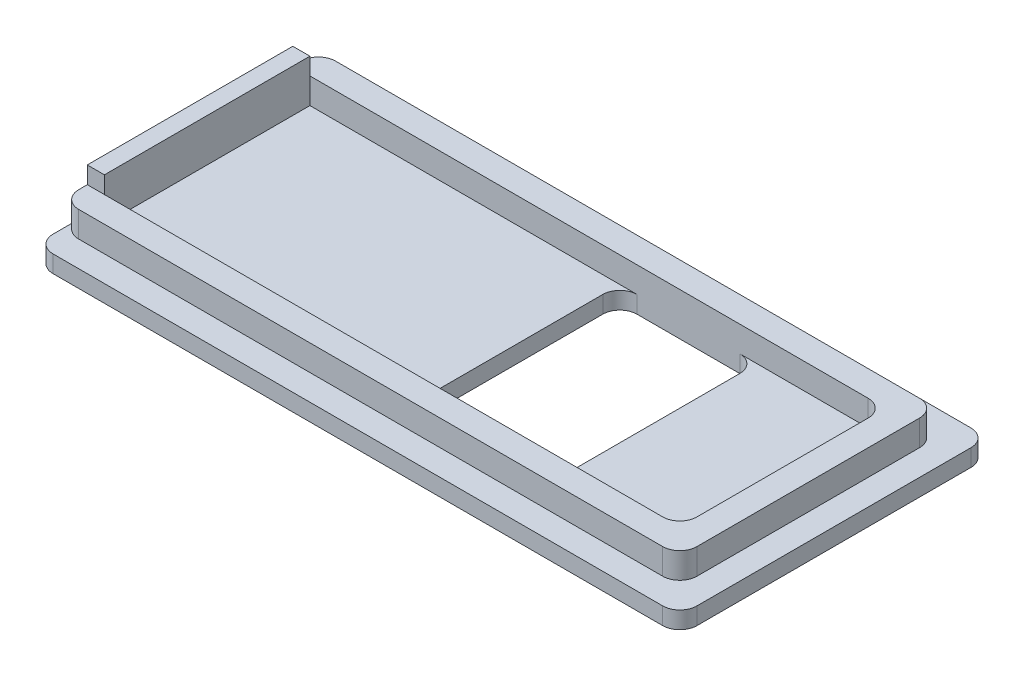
ISO-10303-21;
HEADER;
FILE_DESCRIPTION(('STEP AP214'),'2;1');
FILE_NAME('part.step','',(''),(''),'','','');
FILE_SCHEMA(('AUTOMOTIVE_DESIGN { 1 0 10303 214 1 1 1 1 }'));
ENDSEC;
DATA;
#1=APPLICATION_CONTEXT('core data for automotive mechanical design processes');
#2=APPLICATION_PROTOCOL_DEFINITION('international standard','automotive_design',2000,#1);
#3=PRODUCT_CONTEXT('',#1,'mechanical');
#4=PRODUCT('Part','Part','',(#3));
#5=PRODUCT_RELATED_PRODUCT_CATEGORY('part','',(#4));
#6=PRODUCT_DEFINITION_FORMATION('','',#4);
#7=PRODUCT_DEFINITION_CONTEXT('part definition',#1,'design');
#8=PRODUCT_DEFINITION('design','',#6,#7);
#9=PRODUCT_DEFINITION_SHAPE('','',#8);
#10=(LENGTH_UNIT() NAMED_UNIT(*) SI_UNIT(.MILLI.,.METRE.));
#11=(NAMED_UNIT(*) PLANE_ANGLE_UNIT() SI_UNIT($,.RADIAN.));
#12=(NAMED_UNIT(*) SI_UNIT($,.STERADIAN.) SOLID_ANGLE_UNIT());
#13=UNCERTAINTY_MEASURE_WITH_UNIT(LENGTH_MEASURE(1.E-05),#10,'distance_accuracy_value','');
#14=(GEOMETRIC_REPRESENTATION_CONTEXT(3) GLOBAL_UNCERTAINTY_ASSIGNED_CONTEXT((#13)) GLOBAL_UNIT_ASSIGNED_CONTEXT((#10,
#11,#12)) REPRESENTATION_CONTEXT('',''));
#15=CARTESIAN_POINT('',(0.,0.,0.));
#16=DIRECTION('',(0.,0.,1.));
#17=DIRECTION('',(1.,0.,0.));
#18=AXIS2_PLACEMENT_3D('',#15,#16,#17);
#19=CARTESIAN_POINT('',(0.,1.,0.));
#20=DIRECTION('',(0.,-1.,0.));
#21=DIRECTION('',(0.,0.,-1.));
#22=AXIS2_PLACEMENT_3D('',#19,#20,#21);
#23=PLANE('',#22);
#24=DIRECTION('',(0.,0.,1.));
#25=VECTOR('',#24,1.);
#26=CARTESIAN_POINT('',(19.1,1.,-15.));
#27=LINE('',#26,#25);
#28=CARTESIAN_POINT('',(19.1,1.,-14.));
#29=VERTEX_POINT('',#28);
#30=CARTESIAN_POINT('',(19.1,1.,-4.));
#31=VERTEX_POINT('',#30);
#32=EDGE_CURVE('E438',#29,#31,#27,.T.);
#33=ORIENTED_EDGE('',*,*,#32,.F.);
#34=CARTESIAN_POINT('',(20.1,1.,-14.));
#35=DIRECTION('',(0.,-1.,0.));
#36=DIRECTION('',(0.,0.,-1.));
#37=AXIS2_PLACEMENT_3D('',#34,#35,#36);
#38=CIRCLE('',#37,1.);
#39=CARTESIAN_POINT('',(20.1,1.,-15.));
#40=VERTEX_POINT('',#39);
#41=EDGE_CURVE('E464',#29,#40,#38,.T.);
#42=ORIENTED_EDGE('',*,*,#41,.T.);
#43=DIRECTION('',(1.,0.,0.));
#44=VECTOR('',#43,1.);
#45=CARTESIAN_POINT('',(0.,1.,-15.));
#46=LINE('',#45,#44);
#47=CARTESIAN_POINT('',(1.,1.,-15.));
#48=VERTEX_POINT('',#47);
#49=EDGE_CURVE('E51',#48,#40,#46,.T.);
#50=ORIENTED_EDGE('',*,*,#49,.F.);
#51=DIRECTION('',(0.,0.,-1.));
#52=VECTOR('',#51,1.);
#53=CARTESIAN_POINT('',(1.,1.,-15.));
#54=LINE('',#53,#52);
#55=CARTESIAN_POINT('',(1.,1.,-3.));
#56=VERTEX_POINT('',#55);
#57=EDGE_CURVE('E270',#56,#48,#54,.T.);
#58=ORIENTED_EDGE('',*,*,#57,.F.);
#59=DIRECTION('',(1.,0.,0.));
#60=VECTOR('',#59,1.);
#61=CARTESIAN_POINT('',(0.,1.,-3.));
#62=LINE('',#61,#60);
#63=CARTESIAN_POINT('',(20.1,1.,-3.));
#64=VERTEX_POINT('',#63);
#65=EDGE_CURVE('E313',#56,#64,#62,.T.);
#66=ORIENTED_EDGE('',*,*,#65,.T.);
#67=CARTESIAN_POINT('',(20.1,1.,-4.));
#68=DIRECTION('',(0.,-1.,0.));
#69=DIRECTION('',(0.,0.,-1.));
#70=AXIS2_PLACEMENT_3D('',#67,#68,#69);
#71=CIRCLE('',#70,1.);
#72=EDGE_CURVE('E490',#64,#31,#71,.T.);
#73=ORIENTED_EDGE('',*,*,#72,.T.);
#74=EDGE_LOOP('',(#33,#42,#50,#58,#66,#73));
#75=FACE_BOUND('',#74,.T.);
#76=ADVANCED_FACE('F36',(#75),#23,.F.);
#77=DIRECTION('',(0.,0.,1.));
#78=VECTOR('',#77,1.);
#79=CARTESIAN_POINT('',(34.6,1.,0.));
#80=LINE('',#79,#78);
#81=CARTESIAN_POINT('',(34.6,1.,-14.));
#82=VERTEX_POINT('',#81);
#83=CARTESIAN_POINT('',(34.6,1.,-4.));
#84=VERTEX_POINT('',#83);
#85=EDGE_CURVE('E303',#82,#84,#80,.T.);
#86=ORIENTED_EDGE('',*,*,#85,.F.);
#87=CARTESIAN_POINT('',(33.6,1.,-14.));
#88=DIRECTION('',(0.,-1.,0.));
#89=DIRECTION('',(0.,0.,-1.));
#90=AXIS2_PLACEMENT_3D('',#87,#88,#89);
#91=CIRCLE('',#90,1.);
#92=CARTESIAN_POINT('',(33.6,1.,-15.));
#93=VERTEX_POINT('',#92);
#94=EDGE_CURVE('E385',#82,#93,#91,.F.);
#95=ORIENTED_EDGE('',*,*,#94,.T.);
#96=CARTESIAN_POINT('',(26.1,1.,-15.));
#97=VERTEX_POINT('',#96);
#98=EDGE_CURVE('E59',#97,#93,#46,.T.);
#99=ORIENTED_EDGE('',*,*,#98,.F.);
#100=CARTESIAN_POINT('',(26.1,1.,-14.));
#101=DIRECTION('',(0.,-1.,0.));
#102=DIRECTION('',(0.,0.,-1.));
#103=AXIS2_PLACEMENT_3D('',#100,#101,#102);
#104=CIRCLE('',#103,1.);
#105=CARTESIAN_POINT('',(27.1,1.,-14.));
#106=VERTEX_POINT('',#105);
#107=EDGE_CURVE('E44',#97,#106,#104,.T.);
#108=ORIENTED_EDGE('',*,*,#107,.T.);
#109=DIRECTION('',(0.,0.,-1.));
#110=VECTOR('',#109,1.);
#111=CARTESIAN_POINT('',(27.1,1.,-15.));
#112=LINE('',#111,#110);
#113=CARTESIAN_POINT('',(27.1,1.,-4.));
#114=VERTEX_POINT('',#113);
#115=EDGE_CURVE('E433',#114,#106,#112,.T.);
#116=ORIENTED_EDGE('',*,*,#115,.F.);
#117=CARTESIAN_POINT('',(26.1,1.,-4.));
#118=DIRECTION('',(0.,-1.,0.));
#119=DIRECTION('',(0.,0.,-1.));
#120=AXIS2_PLACEMENT_3D('',#117,#118,#119);
#121=CIRCLE('',#120,1.);
#122=CARTESIAN_POINT('',(26.1,1.,-3.));
#123=VERTEX_POINT('',#122);
#124=EDGE_CURVE('E478',#114,#123,#121,.T.);
#125=ORIENTED_EDGE('',*,*,#124,.T.);
#126=CARTESIAN_POINT('',(33.6,1.,-3.));
#127=VERTEX_POINT('',#126);
#128=EDGE_CURVE('E306',#123,#127,#62,.T.);
#129=ORIENTED_EDGE('',*,*,#128,.T.);
#130=CARTESIAN_POINT('',(33.6,1.,-4.));
#131=DIRECTION('',(0.,-1.,0.));
#132=DIRECTION('',(0.,0.,-1.));
#133=AXIS2_PLACEMENT_3D('',#130,#131,#132);
#134=CIRCLE('',#133,1.);
#135=EDGE_CURVE('E383',#127,#84,#134,.F.);
#136=ORIENTED_EDGE('',*,*,#135,.T.);
#137=EDGE_LOOP('',(#86,#95,#99,#108,#116,#125,#129,#136));
#138=FACE_BOUND('',#137,.T.);
#139=ADVANCED_FACE('F495',(#138),#23,.F.);
#140=CARTESIAN_POINT('',(0.,2.5,-15.));
#141=DIRECTION('',(0.,0.,-1.));
#142=DIRECTION('',(-1.,0.,0.));
#143=AXIS2_PLACEMENT_3D('',#140,#141,#142);
#144=PLANE('',#143);
#145=ORIENTED_EDGE('',*,*,#49,.T.);
#146=DIRECTION('',(0.,1.,0.));
#147=VECTOR('',#146,1.);
#148=CARTESIAN_POINT('',(20.1,0.,-15.));
#149=LINE('',#148,#147);
#150=CARTESIAN_POINT('',(20.1,0.,-15.));
#151=VERTEX_POINT('',#150);
#152=EDGE_CURVE('E474',#40,#151,#149,.F.);
#153=ORIENTED_EDGE('',*,*,#152,.T.);
#154=DIRECTION('',(-1.,0.,0.));
#155=VECTOR('',#154,1.);
#156=CARTESIAN_POINT('',(19.1,0.,-15.));
#157=LINE('',#156,#155);
#158=CARTESIAN_POINT('',(26.1,0.,-15.));
#159=VERTEX_POINT('',#158);
#160=EDGE_CURVE('E449',#159,#151,#157,.T.);
#161=ORIENTED_EDGE('',*,*,#160,.F.);
#162=DIRECTION('',(0.,1.,0.));
#163=VECTOR('',#162,1.);
#164=CARTESIAN_POINT('',(26.1,1.,-15.));
#165=LINE('',#164,#163);
#166=EDGE_CURVE('E479',#159,#97,#165,.T.);
#167=ORIENTED_EDGE('',*,*,#166,.T.);
#168=ORIENTED_EDGE('',*,*,#98,.T.);
#169=DIRECTION('',(0.,-1.,0.));
#170=VECTOR('',#169,1.);
#171=CARTESIAN_POINT('',(33.6,2.5,-15.));
#172=LINE('',#171,#170);
#173=CARTESIAN_POINT('',(33.6,2.5,-15.));
#174=VERTEX_POINT('',#173);
#175=EDGE_CURVE('E387',#93,#174,#172,.F.);
#176=ORIENTED_EDGE('',*,*,#175,.T.);
#177=DIRECTION('',(1.,0.,0.));
#178=VECTOR('',#177,1.);
#179=CARTESIAN_POINT('',(0.,2.5,-15.));
#180=LINE('',#179,#178);
#181=CARTESIAN_POINT('',(1.,2.5,-15.));
#182=VERTEX_POINT('',#181);
#183=EDGE_CURVE('E287',#182,#174,#180,.T.);
#184=ORIENTED_EDGE('',*,*,#183,.F.);
#185=DIRECTION('',(0.,-1.,0.));
#186=VECTOR('',#185,1.);
#187=CARTESIAN_POINT('',(1.,3.5,-15.));
#188=LINE('',#187,#186);
#189=EDGE_CURVE('E450',#182,#48,#188,.T.);
#190=ORIENTED_EDGE('',*,*,#189,.T.);
#191=EDGE_LOOP('',(#145,#153,#161,#167,#168,#176,#184,#190));
#192=FACE_BOUND('',#191,.T.);
#193=ADVANCED_FACE('F457',(#192),#144,.F.);
#194=CARTESIAN_POINT('',(0.,2.5,-3.));
#195=DIRECTION('',(0.,0.,-1.));
#196=DIRECTION('',(-1.,0.,0.));
#197=AXIS2_PLACEMENT_3D('',#194,#195,#196);
#198=PLANE('',#197);
#199=ORIENTED_EDGE('',*,*,#128,.F.);
#200=DIRECTION('',(0.,1.,0.));
#201=VECTOR('',#200,1.);
#202=CARTESIAN_POINT('',(26.1,2.5,-3.));
#203=LINE('',#202,#201);
#204=CARTESIAN_POINT('',(26.1,0.,-3.));
#205=VERTEX_POINT('',#204);
#206=EDGE_CURVE('E509',#123,#205,#203,.F.);
#207=ORIENTED_EDGE('',*,*,#206,.T.);
#208=DIRECTION('',(1.,0.,0.));
#209=VECTOR('',#208,1.);
#210=CARTESIAN_POINT('',(19.1,0.,-3.));
#211=LINE('',#210,#209);
#212=CARTESIAN_POINT('',(20.1,0.,-3.));
#213=VERTEX_POINT('',#212);
#214=EDGE_CURVE('E528',#213,#205,#211,.T.);
#215=ORIENTED_EDGE('',*,*,#214,.F.);
#216=DIRECTION('',(0.,1.,0.));
#217=VECTOR('',#216,1.);
#218=CARTESIAN_POINT('',(20.1,2.5,-3.));
#219=LINE('',#218,#217);
#220=EDGE_CURVE('E507',#213,#64,#219,.T.);
#221=ORIENTED_EDGE('',*,*,#220,.T.);
#222=ORIENTED_EDGE('',*,*,#65,.F.);
#223=DIRECTION('',(0.,-1.,0.));
#224=VECTOR('',#223,1.);
#225=CARTESIAN_POINT('',(1.,3.5,-3.));
#226=LINE('',#225,#224);
#227=CARTESIAN_POINT('',(1.,2.5,-3.));
#228=VERTEX_POINT('',#227);
#229=EDGE_CURVE('E279',#228,#56,#226,.T.);
#230=ORIENTED_EDGE('',*,*,#229,.F.);
#231=DIRECTION('',(1.,0.,0.));
#232=VECTOR('',#231,1.);
#233=CARTESIAN_POINT('',(0.,2.5,-3.));
#234=LINE('',#233,#232);
#235=CARTESIAN_POINT('',(33.6,2.5,-3.));
#236=VERTEX_POINT('',#235);
#237=EDGE_CURVE('E290',#228,#236,#234,.T.);
#238=ORIENTED_EDGE('',*,*,#237,.T.);
#239=DIRECTION('',(0.,-1.,0.));
#240=VECTOR('',#239,1.);
#241=CARTESIAN_POINT('',(33.6,2.5,-3.));
#242=LINE('',#241,#240);
#243=EDGE_CURVE('E389',#236,#127,#242,.T.);
#244=ORIENTED_EDGE('',*,*,#243,.T.);
#245=EDGE_LOOP('',(#199,#207,#215,#221,#222,#230,#238,#244));
#246=FACE_BOUND('',#245,.T.);
#247=ADVANCED_FACE('F533',(#246),#198,.T.);
#248=CARTESIAN_POINT('',(0.,1.,0.));
#249=DIRECTION('',(1.,0.,0.));
#250=DIRECTION('',(0.,0.,-1.));
#251=AXIS2_PLACEMENT_3D('',#248,#249,#250);
#252=PLANE('',#251);
#253=DIRECTION('',(0.,0.,1.));
#254=VECTOR('',#253,1.);
#255=CARTESIAN_POINT('',(0.,2.5,0.));
#256=LINE('',#255,#254);
#257=CARTESIAN_POINT('',(0.,2.5,-15.5));
#258=VERTEX_POINT('',#257);
#259=CARTESIAN_POINT('',(0.,2.5,-15.));
#260=VERTEX_POINT('',#259);
#261=EDGE_CURVE('E295',#258,#260,#256,.T.);
#262=ORIENTED_EDGE('',*,*,#261,.F.);
#263=DIRECTION('',(0.,-1.,0.));
#264=VECTOR('',#263,1.);
#265=CARTESIAN_POINT('',(0.,1.,-15.5));
#266=LINE('',#265,#264);
#267=CARTESIAN_POINT('',(0.,1.,-15.5));
#268=VERTEX_POINT('',#267);
#269=EDGE_CURVE('E421',#258,#268,#266,.T.);
#270=ORIENTED_EDGE('',*,*,#269,.T.);
#271=DIRECTION('',(0.,0.,1.));
#272=VECTOR('',#271,1.);
#273=CARTESIAN_POINT('',(0.,1.,0.));
#274=LINE('',#273,#272);
#275=CARTESIAN_POINT('',(0.,1.,-17.));
#276=VERTEX_POINT('',#275);
#277=EDGE_CURVE('E330',#276,#268,#274,.T.);
#278=ORIENTED_EDGE('',*,*,#277,.F.);
#279=DIRECTION('',(0.,-1.,0.));
#280=VECTOR('',#279,1.);
#281=CARTESIAN_POINT('',(0.,1.,-17.));
#282=LINE('',#281,#280);
#283=CARTESIAN_POINT('',(0.,0.,-17.));
#284=VERTEX_POINT('',#283);
#285=EDGE_CURVE('E345',#276,#284,#282,.T.);
#286=ORIENTED_EDGE('',*,*,#285,.T.);
#287=DIRECTION('',(0.,0.,1.));
#288=VECTOR('',#287,1.);
#289=CARTESIAN_POINT('',(0.,0.,0.));
#290=LINE('',#289,#288);
#291=CARTESIAN_POINT('',(0.,0.,-1.));
#292=VERTEX_POINT('',#291);
#293=EDGE_CURVE('E562',#284,#292,#290,.T.);
#294=ORIENTED_EDGE('',*,*,#293,.T.);
#295=DIRECTION('',(0.,-1.,0.));
#296=VECTOR('',#295,1.);
#297=CARTESIAN_POINT('',(0.,1.,-1.));
#298=LINE('',#297,#296);
#299=CARTESIAN_POINT('',(0.,1.,-1.));
#300=VERTEX_POINT('',#299);
#301=EDGE_CURVE('E343',#292,#300,#298,.F.);
#302=ORIENTED_EDGE('',*,*,#301,.T.);
#303=CARTESIAN_POINT('',(0.,1.,-2.5));
#304=VERTEX_POINT('',#303);
#305=EDGE_CURVE('E324',#304,#300,#274,.T.);
#306=ORIENTED_EDGE('',*,*,#305,.F.);
#307=DIRECTION('',(0.,-1.,0.));
#308=VECTOR('',#307,1.);
#309=CARTESIAN_POINT('',(0.,1.,-2.5));
#310=LINE('',#309,#308);
#311=CARTESIAN_POINT('',(0.,2.5,-2.5));
#312=VERTEX_POINT('',#311);
#313=EDGE_CURVE('E348',#304,#312,#310,.F.);
#314=ORIENTED_EDGE('',*,*,#313,.T.);
#315=CARTESIAN_POINT('',(0.,2.5,-3.));
#316=VERTEX_POINT('',#315);
#317=EDGE_CURVE('E275',#316,#312,#256,.T.);
#318=ORIENTED_EDGE('',*,*,#317,.F.);
#319=DIRECTION('',(0.,-1.,0.));
#320=VECTOR('',#319,1.);
#321=CARTESIAN_POINT('',(0.,3.5,-3.));
#322=LINE('',#321,#320);
#323=CARTESIAN_POINT('',(0.,3.5,-3.));
#324=VERTEX_POINT('',#323);
#325=EDGE_CURVE('E254',#324,#316,#322,.T.);
#326=ORIENTED_EDGE('',*,*,#325,.F.);
#327=DIRECTION('',(0.,0.,1.));
#328=VECTOR('',#327,1.);
#329=CARTESIAN_POINT('',(0.,3.5,-3.));
#330=LINE('',#329,#328);
#331=CARTESIAN_POINT('',(0.,3.5,-15.));
#332=VERTEX_POINT('',#331);
#333=EDGE_CURVE('E261',#332,#324,#330,.T.);
#334=ORIENTED_EDGE('',*,*,#333,.F.);
#335=DIRECTION('',(0.,-1.,0.));
#336=VECTOR('',#335,1.);
#337=CARTESIAN_POINT('',(0.,3.5,-15.));
#338=LINE('',#337,#336);
#339=EDGE_CURVE('E447',#332,#260,#338,.T.);
#340=ORIENTED_EDGE('',*,*,#339,.T.);
#341=EDGE_LOOP('',(#262,#270,#278,#286,#294,#302,#306,#314,#318,#326,#334,#340));
#342=FACE_BOUND('',#341,.T.);
#343=ADVANCED_FACE('F273',(#342),#252,.F.);
#344=CARTESIAN_POINT('',(0.,1.,0.));
#345=DIRECTION('',(0.,0.,-1.));
#346=DIRECTION('',(-1.,0.,0.));
#347=AXIS2_PLACEMENT_3D('',#344,#345,#346);
#348=PLANE('',#347);
#349=DIRECTION('',(1.,0.,0.));
#350=VECTOR('',#349,1.);
#351=CARTESIAN_POINT('',(0.,0.,0.));
#352=LINE('',#351,#350);
#353=CARTESIAN_POINT('',(1.,0.,0.));
#354=VERTEX_POINT('',#353);
#355=CARTESIAN_POINT('',(36.6,0.,0.));
#356=VERTEX_POINT('',#355);
#357=EDGE_CURVE('E607',#354,#356,#352,.T.);
#358=ORIENTED_EDGE('',*,*,#357,.T.);
#359=DIRECTION('',(0.,-1.,0.));
#360=VECTOR('',#359,1.);
#361=CARTESIAN_POINT('',(36.6,1.,0.));
#362=LINE('',#361,#360);
#363=CARTESIAN_POINT('',(36.6,1.,0.));
#364=VERTEX_POINT('',#363);
#365=EDGE_CURVE('E408',#356,#364,#362,.F.);
#366=ORIENTED_EDGE('',*,*,#365,.T.);
#367=DIRECTION('',(1.,0.,0.));
#368=VECTOR('',#367,1.);
#369=CARTESIAN_POINT('',(0.,1.,0.));
#370=LINE('',#369,#368);
#371=CARTESIAN_POINT('',(1.,1.,0.));
#372=VERTEX_POINT('',#371);
#373=EDGE_CURVE('E336',#372,#364,#370,.T.);
#374=ORIENTED_EDGE('',*,*,#373,.F.);
#375=DIRECTION('',(0.,-1.,0.));
#376=VECTOR('',#375,1.);
#377=CARTESIAN_POINT('',(1.,1.,0.));
#378=LINE('',#377,#376);
#379=EDGE_CURVE('E405',#372,#354,#378,.T.);
#380=ORIENTED_EDGE('',*,*,#379,.T.);
#381=EDGE_LOOP('',(#358,#366,#374,#380));
#382=FACE_BOUND('',#381,.T.);
#383=ADVANCED_FACE('F632',(#382),#348,.F.);
#384=CARTESIAN_POINT('',(37.6,1.,0.));
#385=DIRECTION('',(-1.,0.,0.));
#386=DIRECTION('',(0.,0.,1.));
#387=AXIS2_PLACEMENT_3D('',#384,#385,#386);
#388=PLANE('',#387);
#389=DIRECTION('',(0.,0.,-1.));
#390=VECTOR('',#389,1.);
#391=CARTESIAN_POINT('',(37.6,0.,0.));
#392=LINE('',#391,#390);
#393=CARTESIAN_POINT('',(37.6,0.,-1.));
#394=VERTEX_POINT('',#393);
#395=CARTESIAN_POINT('',(37.6,0.,-17.));
#396=VERTEX_POINT('',#395);
#397=EDGE_CURVE('E609',#394,#396,#392,.T.);
#398=ORIENTED_EDGE('',*,*,#397,.T.);
#399=DIRECTION('',(0.,-1.,0.));
#400=VECTOR('',#399,1.);
#401=CARTESIAN_POINT('',(37.6,1.,-17.));
#402=LINE('',#401,#400);
#403=CARTESIAN_POINT('',(37.6,1.,-17.));
#404=VERTEX_POINT('',#403);
#405=EDGE_CURVE('E403',#396,#404,#402,.F.);
#406=ORIENTED_EDGE('',*,*,#405,.T.);
#407=DIRECTION('',(0.,0.,-1.));
#408=VECTOR('',#407,1.);
#409=CARTESIAN_POINT('',(37.6,1.,0.));
#410=LINE('',#409,#408);
#411=CARTESIAN_POINT('',(37.6,1.,-1.));
#412=VERTEX_POINT('',#411);
#413=EDGE_CURVE('E599',#412,#404,#410,.T.);
#414=ORIENTED_EDGE('',*,*,#413,.F.);
#415=DIRECTION('',(0.,-1.,0.));
#416=VECTOR('',#415,1.);
#417=CARTESIAN_POINT('',(37.6,1.,-1.));
#418=LINE('',#417,#416);
#419=EDGE_CURVE('E400',#412,#394,#418,.T.);
#420=ORIENTED_EDGE('',*,*,#419,.T.);
#421=EDGE_LOOP('',(#398,#406,#414,#420));
#422=FACE_BOUND('',#421,.T.);
#423=ADVANCED_FACE('F640',(#422),#388,.F.);
#424=CARTESIAN_POINT('',(0.,1.,-18.));
#425=DIRECTION('',(0.,0.,1.));
#426=DIRECTION('',(1.,0.,0.));
#427=AXIS2_PLACEMENT_3D('',#424,#425,#426);
#428=PLANE('',#427);
#429=DIRECTION('',(-1.,0.,0.));
#430=VECTOR('',#429,1.);
#431=CARTESIAN_POINT('',(0.,0.,-18.));
#432=LINE('',#431,#430);
#433=CARTESIAN_POINT('',(36.6,0.,-18.));
#434=VERTEX_POINT('',#433);
#435=CARTESIAN_POINT('',(1.,0.,-18.));
#436=VERTEX_POINT('',#435);
#437=EDGE_CURVE('E331',#434,#436,#432,.T.);
#438=ORIENTED_EDGE('',*,*,#437,.T.);
#439=DIRECTION('',(0.,-1.,0.));
#440=VECTOR('',#439,1.);
#441=CARTESIAN_POINT('',(1.,1.,-18.));
#442=LINE('',#441,#440);
#443=CARTESIAN_POINT('',(1.,1.,-18.));
#444=VERTEX_POINT('',#443);
#445=EDGE_CURVE('E368',#436,#444,#442,.F.);
#446=ORIENTED_EDGE('',*,*,#445,.T.);
#447=DIRECTION('',(-1.,0.,0.));
#448=VECTOR('',#447,1.);
#449=CARTESIAN_POINT('',(0.,1.,-18.));
#450=LINE('',#449,#448);
#451=CARTESIAN_POINT('',(36.6,1.,-18.));
#452=VERTEX_POINT('',#451);
#453=EDGE_CURVE('E598',#452,#444,#450,.T.);
#454=ORIENTED_EDGE('',*,*,#453,.F.);
#455=DIRECTION('',(0.,-1.,0.));
#456=VECTOR('',#455,1.);
#457=CARTESIAN_POINT('',(36.6,1.,-18.));
#458=LINE('',#457,#456);
#459=EDGE_CURVE('E365',#452,#434,#458,.T.);
#460=ORIENTED_EDGE('',*,*,#459,.T.);
#461=EDGE_LOOP('',(#438,#446,#454,#460));
#462=FACE_BOUND('',#461,.T.);
#463=ADVANCED_FACE('F618',(#462),#428,.F.);
#464=ORIENTED_EDGE('',*,*,#453,.T.);
#465=CARTESIAN_POINT('',(1.,1.,-17.));
#466=DIRECTION('',(0.,-1.,0.));
#467=DIRECTION('',(0.,0.,-1.));
#468=AXIS2_PLACEMENT_3D('',#465,#466,#467);
#469=CIRCLE('',#468,1.);
#470=EDGE_CURVE('E376',#444,#276,#469,.F.);
#471=ORIENTED_EDGE('',*,*,#470,.T.);
#472=ORIENTED_EDGE('',*,*,#277,.T.);
#473=CARTESIAN_POINT('',(1.,1.,-15.5));
#474=DIRECTION('',(0.,-1.,0.));
#475=DIRECTION('',(0.,0.,-1.));
#476=AXIS2_PLACEMENT_3D('',#473,#474,#475);
#477=CIRCLE('',#476,1.);
#478=CARTESIAN_POINT('',(1.,1.,-16.5));
#479=VERTEX_POINT('',#478);
#480=EDGE_CURVE('E430',#268,#479,#477,.T.);
#481=ORIENTED_EDGE('',*,*,#480,.T.);
#482=DIRECTION('',(1.,0.,0.));
#483=VECTOR('',#482,1.);
#484=CARTESIAN_POINT('',(0.,1.,-16.5));
#485=LINE('',#484,#483);
#486=CARTESIAN_POINT('',(35.1,1.,-16.5));
#487=VERTEX_POINT('',#486);
#488=EDGE_CURVE('E425',#479,#487,#485,.T.);
#489=ORIENTED_EDGE('',*,*,#488,.T.);
#490=CARTESIAN_POINT('',(35.1,1.,-15.5));
#491=DIRECTION('',(0.,-1.,0.));
#492=DIRECTION('',(0.,0.,-1.));
#493=AXIS2_PLACEMENT_3D('',#490,#491,#492);
#494=CIRCLE('',#493,1.);
#495=CARTESIAN_POINT('',(36.1,1.,-15.5));
#496=VERTEX_POINT('',#495);
#497=EDGE_CURVE('E417',#487,#496,#494,.T.);
#498=ORIENTED_EDGE('',*,*,#497,.T.);
#499=DIRECTION('',(0.,0.,1.));
#500=VECTOR('',#499,1.);
#501=CARTESIAN_POINT('',(36.1,1.,0.));
#502=LINE('',#501,#500);
#503=CARTESIAN_POINT('',(36.1,1.,-2.5));
#504=VERTEX_POINT('',#503);
#505=EDGE_CURVE('E309',#496,#504,#502,.T.);
#506=ORIENTED_EDGE('',*,*,#505,.T.);
#507=CARTESIAN_POINT('',(35.1,1.,-2.5));
#508=DIRECTION('',(0.,-1.,0.));
#509=DIRECTION('',(0.,0.,-1.));
#510=AXIS2_PLACEMENT_3D('',#507,#508,#509);
#511=CIRCLE('',#510,1.);
#512=CARTESIAN_POINT('',(35.1,1.,-1.5));
#513=VERTEX_POINT('',#512);
#514=EDGE_CURVE('E419',#504,#513,#511,.T.);
#515=ORIENTED_EDGE('',*,*,#514,.T.);
#516=DIRECTION('',(1.,0.,0.));
#517=VECTOR('',#516,1.);
#518=CARTESIAN_POINT('',(0.,1.,-1.5));
#519=LINE('',#518,#517);
#520=CARTESIAN_POINT('',(1.,1.,-1.5));
#521=VERTEX_POINT('',#520);
#522=EDGE_CURVE('E320',#521,#513,#519,.T.);
#523=ORIENTED_EDGE('',*,*,#522,.F.);
#524=CARTESIAN_POINT('',(1.,1.,-2.5));
#525=DIRECTION('',(0.,-1.,0.));
#526=DIRECTION('',(0.,0.,-1.));
#527=AXIS2_PLACEMENT_3D('',#524,#525,#526);
#528=CIRCLE('',#527,1.);
#529=EDGE_CURVE('E410',#521,#304,#528,.T.);
#530=ORIENTED_EDGE('',*,*,#529,.T.);
#531=ORIENTED_EDGE('',*,*,#305,.T.);
#532=CARTESIAN_POINT('',(1.,1.,-1.));
#533=DIRECTION('',(0.,-1.,0.));
#534=DIRECTION('',(0.,0.,-1.));
#535=AXIS2_PLACEMENT_3D('',#532,#533,#534);
#536=CIRCLE('',#535,1.);
#537=EDGE_CURVE('E370',#300,#372,#536,.F.);
#538=ORIENTED_EDGE('',*,*,#537,.T.);
#539=ORIENTED_EDGE('',*,*,#373,.T.);
#540=CARTESIAN_POINT('',(36.6,1.,-1.));
#541=DIRECTION('',(0.,-1.,0.));
#542=DIRECTION('',(0.,0.,-1.));
#543=AXIS2_PLACEMENT_3D('',#540,#541,#542);
#544=CIRCLE('',#543,1.);
#545=EDGE_CURVE('E372',#364,#412,#544,.F.);
#546=ORIENTED_EDGE('',*,*,#545,.T.);
#547=ORIENTED_EDGE('',*,*,#413,.T.);
#548=CARTESIAN_POINT('',(36.6,1.,-17.));
#549=DIRECTION('',(0.,-1.,0.));
#550=DIRECTION('',(0.,0.,-1.));
#551=AXIS2_PLACEMENT_3D('',#548,#549,#550);
#552=CIRCLE('',#551,1.);
#553=EDGE_CURVE('E374',#404,#452,#552,.F.);
#554=ORIENTED_EDGE('',*,*,#553,.T.);
#555=EDGE_LOOP('',(#464,#471,#472,#481,#489,#498,#506,#515,#523,#530,#531,#538,#539,#546,#547,#554));
#556=FACE_BOUND('',#555,.T.);
#557=ADVANCED_FACE('F571',(#556),#23,.F.);
#558=CARTESIAN_POINT('',(0.,0.,0.));
#559=DIRECTION('',(0.,-1.,0.));
#560=DIRECTION('',(0.,0.,-1.));
#561=AXIS2_PLACEMENT_3D('',#558,#559,#560);
#562=PLANE('',#561);
#563=ORIENTED_EDGE('',*,*,#160,.T.);
#564=CARTESIAN_POINT('',(20.1,0.,-14.));
#565=DIRECTION('',(0.,-1.,0.));
#566=DIRECTION('',(0.,0.,-1.));
#567=AXIS2_PLACEMENT_3D('',#564,#565,#566);
#568=CIRCLE('',#567,1.);
#569=CARTESIAN_POINT('',(19.1,0.,-14.));
#570=VERTEX_POINT('',#569);
#571=EDGE_CURVE('E470',#151,#570,#568,.F.);
#572=ORIENTED_EDGE('',*,*,#571,.T.);
#573=DIRECTION('',(0.,0.,1.));
#574=VECTOR('',#573,1.);
#575=CARTESIAN_POINT('',(19.1,0.,-15.));
#576=LINE('',#575,#574);
#577=CARTESIAN_POINT('',(19.1,0.,-4.));
#578=VERTEX_POINT('',#577);
#579=EDGE_CURVE('E437',#570,#578,#576,.T.);
#580=ORIENTED_EDGE('',*,*,#579,.T.);
#581=CARTESIAN_POINT('',(20.1,0.,-4.));
#582=DIRECTION('',(0.,-1.,0.));
#583=DIRECTION('',(0.,0.,-1.));
#584=AXIS2_PLACEMENT_3D('',#581,#582,#583);
#585=CIRCLE('',#584,1.);
#586=EDGE_CURVE('E471',#578,#213,#585,.F.);
#587=ORIENTED_EDGE('',*,*,#586,.T.);
#588=ORIENTED_EDGE('',*,*,#214,.T.);
#589=CARTESIAN_POINT('',(26.1,0.,-4.));
#590=DIRECTION('',(0.,-1.,0.));
#591=DIRECTION('',(0.,0.,-1.));
#592=AXIS2_PLACEMENT_3D('',#589,#590,#591);
#593=CIRCLE('',#592,1.);
#594=CARTESIAN_POINT('',(27.1,0.,-4.));
#595=VERTEX_POINT('',#594);
#596=EDGE_CURVE('E482',#205,#595,#593,.F.);
#597=ORIENTED_EDGE('',*,*,#596,.T.);
#598=DIRECTION('',(0.,0.,-1.));
#599=VECTOR('',#598,1.);
#600=CARTESIAN_POINT('',(27.1,0.,-15.));
#601=LINE('',#600,#599);
#602=CARTESIAN_POINT('',(27.1,0.,-14.));
#603=VERTEX_POINT('',#602);
#604=EDGE_CURVE('E537',#595,#603,#601,.T.);
#605=ORIENTED_EDGE('',*,*,#604,.T.);
#606=CARTESIAN_POINT('',(26.1,0.,-14.));
#607=DIRECTION('',(0.,-1.,0.));
#608=DIRECTION('',(0.,0.,-1.));
#609=AXIS2_PLACEMENT_3D('',#606,#607,#608);
#610=CIRCLE('',#609,1.);
#611=EDGE_CURVE('E11',#603,#159,#610,.F.);
#612=ORIENTED_EDGE('',*,*,#611,.T.);
#613=EDGE_LOOP('',(#563,#572,#580,#587,#588,#597,#605,#612));
#614=FACE_BOUND('',#613,.T.);
#615=ORIENTED_EDGE('',*,*,#293,.F.);
#616=CARTESIAN_POINT('',(1.,0.,-17.));
#617=DIRECTION('',(0.,-1.,0.));
#618=DIRECTION('',(0.,0.,-1.));
#619=AXIS2_PLACEMENT_3D('',#616,#617,#618);
#620=CIRCLE('',#619,1.);
#621=EDGE_CURVE('E363',#284,#436,#620,.T.);
#622=ORIENTED_EDGE('',*,*,#621,.T.);
#623=ORIENTED_EDGE('',*,*,#437,.F.);
#624=CARTESIAN_POINT('',(36.6,0.,-17.));
#625=DIRECTION('',(0.,-1.,0.));
#626=DIRECTION('',(0.,0.,-1.));
#627=AXIS2_PLACEMENT_3D('',#624,#625,#626);
#628=CIRCLE('',#627,1.);
#629=EDGE_CURVE('E361',#434,#396,#628,.T.);
#630=ORIENTED_EDGE('',*,*,#629,.T.);
#631=ORIENTED_EDGE('',*,*,#397,.F.);
#632=CARTESIAN_POINT('',(36.6,0.,-1.));
#633=DIRECTION('',(0.,-1.,0.));
#634=DIRECTION('',(0.,0.,-1.));
#635=AXIS2_PLACEMENT_3D('',#632,#633,#634);
#636=CIRCLE('',#635,1.);
#637=EDGE_CURVE('E359',#394,#356,#636,.T.);
#638=ORIENTED_EDGE('',*,*,#637,.T.);
#639=ORIENTED_EDGE('',*,*,#357,.F.);
#640=CARTESIAN_POINT('',(1.,0.,-1.));
#641=DIRECTION('',(0.,-1.,0.));
#642=DIRECTION('',(0.,0.,-1.));
#643=AXIS2_PLACEMENT_3D('',#640,#641,#642);
#644=CIRCLE('',#643,1.);
#645=EDGE_CURVE('E357',#354,#292,#644,.T.);
#646=ORIENTED_EDGE('',*,*,#645,.T.);
#647=EDGE_LOOP('',(#615,#622,#623,#630,#631,#638,#639,#646));
#648=FACE_BOUND('',#647,.T.);
#649=ADVANCED_FACE('F524',(#614,#648),#562,.T.);
#650=CARTESIAN_POINT('',(34.6,2.5,0.));
#651=DIRECTION('',(1.,0.,0.));
#652=DIRECTION('',(0.,0.,-1.));
#653=AXIS2_PLACEMENT_3D('',#650,#651,#652);
#654=PLANE('',#653);
#655=DIRECTION('',(0.,0.,1.));
#656=VECTOR('',#655,1.);
#657=CARTESIAN_POINT('',(34.6,2.5,0.));
#658=LINE('',#657,#656);
#659=CARTESIAN_POINT('',(34.6,2.5,-14.));
#660=VERTEX_POINT('',#659);
#661=CARTESIAN_POINT('',(34.6,2.5,-4.));
#662=VERTEX_POINT('',#661);
#663=EDGE_CURVE('E286',#660,#662,#658,.T.);
#664=ORIENTED_EDGE('',*,*,#663,.F.);
#665=DIRECTION('',(0.,-1.,0.));
#666=VECTOR('',#665,1.);
#667=CARTESIAN_POINT('',(34.6,1.,-14.));
#668=LINE('',#667,#666);
#669=EDGE_CURVE('E380',#660,#82,#668,.T.);
#670=ORIENTED_EDGE('',*,*,#669,.T.);
#671=ORIENTED_EDGE('',*,*,#85,.T.);
#672=DIRECTION('',(0.,-1.,0.));
#673=VECTOR('',#672,1.);
#674=CARTESIAN_POINT('',(34.6,2.5,-4.));
#675=LINE('',#674,#673);
#676=EDGE_CURVE('E378',#84,#662,#675,.F.);
#677=ORIENTED_EDGE('',*,*,#676,.T.);
#678=EDGE_LOOP('',(#664,#670,#671,#677));
#679=FACE_BOUND('',#678,.T.);
#680=ADVANCED_FACE('F551',(#679),#654,.F.);
#681=CARTESIAN_POINT('',(0.,2.5,-1.5));
#682=DIRECTION('',(0.,0.,-1.));
#683=DIRECTION('',(-1.,0.,0.));
#684=AXIS2_PLACEMENT_3D('',#681,#682,#683);
#685=PLANE('',#684);
#686=DIRECTION('',(1.,0.,0.));
#687=VECTOR('',#686,1.);
#688=CARTESIAN_POINT('',(0.,2.5,-1.5));
#689=LINE('',#688,#687);
#690=CARTESIAN_POINT('',(1.,2.5,-1.5));
#691=VERTEX_POINT('',#690);
#692=CARTESIAN_POINT('',(35.1,2.5,-1.5));
#693=VERTEX_POINT('',#692);
#694=EDGE_CURVE('E294',#691,#693,#689,.T.);
#695=ORIENTED_EDGE('',*,*,#694,.F.);
#696=DIRECTION('',(0.,-1.,0.));
#697=VECTOR('',#696,1.);
#698=CARTESIAN_POINT('',(1.,2.5,-1.5));
#699=LINE('',#698,#697);
#700=EDGE_CURVE('E342',#691,#521,#699,.T.);
#701=ORIENTED_EDGE('',*,*,#700,.T.);
#702=ORIENTED_EDGE('',*,*,#522,.T.);
#703=DIRECTION('',(0.,-1.,0.));
#704=VECTOR('',#703,1.);
#705=CARTESIAN_POINT('',(35.1,2.5,-1.5));
#706=LINE('',#705,#704);
#707=EDGE_CURVE('E593',#513,#693,#706,.F.);
#708=ORIENTED_EDGE('',*,*,#707,.T.);
#709=EDGE_LOOP('',(#695,#701,#702,#708));
#710=FACE_BOUND('',#709,.T.);
#711=ADVANCED_FACE('F592',(#710),#685,.F.);
#712=CARTESIAN_POINT('',(36.1,2.5,0.));
#713=DIRECTION('',(1.,0.,0.));
#714=DIRECTION('',(0.,0.,-1.));
#715=AXIS2_PLACEMENT_3D('',#712,#713,#714);
#716=PLANE('',#715);
#717=ORIENTED_EDGE('',*,*,#505,.F.);
#718=DIRECTION('',(0.,-1.,0.));
#719=VECTOR('',#718,1.);
#720=CARTESIAN_POINT('',(36.1,2.5,-15.5));
#721=LINE('',#720,#719);
#722=CARTESIAN_POINT('',(36.1,2.5,-15.5));
#723=VERTEX_POINT('',#722);
#724=EDGE_CURVE('E398',#496,#723,#721,.F.);
#725=ORIENTED_EDGE('',*,*,#724,.T.);
#726=DIRECTION('',(0.,0.,1.));
#727=VECTOR('',#726,1.);
#728=CARTESIAN_POINT('',(36.1,2.5,0.));
#729=LINE('',#728,#727);
#730=CARTESIAN_POINT('',(36.1,2.5,-2.5));
#731=VERTEX_POINT('',#730);
#732=EDGE_CURVE('E298',#723,#731,#729,.T.);
#733=ORIENTED_EDGE('',*,*,#732,.T.);
#734=DIRECTION('',(0.,-1.,0.));
#735=VECTOR('',#734,1.);
#736=CARTESIAN_POINT('',(36.1,1.,-2.5));
#737=LINE('',#736,#735);
#738=EDGE_CURVE('E395',#731,#504,#737,.T.);
#739=ORIENTED_EDGE('',*,*,#738,.T.);
#740=EDGE_LOOP('',(#717,#725,#733,#739));
#741=FACE_BOUND('',#740,.T.);
#742=ADVANCED_FACE('F583',(#741),#716,.T.);
#743=CARTESIAN_POINT('',(0.,2.5,-16.5));
#744=DIRECTION('',(0.,0.,-1.));
#745=DIRECTION('',(-1.,0.,0.));
#746=AXIS2_PLACEMENT_3D('',#743,#744,#745);
#747=PLANE('',#746);
#748=ORIENTED_EDGE('',*,*,#488,.F.);
#749=DIRECTION('',(0.,-1.,0.));
#750=VECTOR('',#749,1.);
#751=CARTESIAN_POINT('',(1.,2.5,-16.5));
#752=LINE('',#751,#750);
#753=CARTESIAN_POINT('',(1.,2.5,-16.5));
#754=VERTEX_POINT('',#753);
#755=EDGE_CURVE('E424',#479,#754,#752,.F.);
#756=ORIENTED_EDGE('',*,*,#755,.T.);
#757=DIRECTION('',(1.,0.,0.));
#758=VECTOR('',#757,1.);
#759=CARTESIAN_POINT('',(0.,2.5,-16.5));
#760=LINE('',#759,#758);
#761=CARTESIAN_POINT('',(35.1,2.5,-16.5));
#762=VERTEX_POINT('',#761);
#763=EDGE_CURVE('E301',#754,#762,#760,.T.);
#764=ORIENTED_EDGE('',*,*,#763,.T.);
#765=DIRECTION('',(0.,-1.,0.));
#766=VECTOR('',#765,1.);
#767=CARTESIAN_POINT('',(35.1,2.5,-16.5));
#768=LINE('',#767,#766);
#769=EDGE_CURVE('E392',#762,#487,#768,.T.);
#770=ORIENTED_EDGE('',*,*,#769,.T.);
#771=EDGE_LOOP('',(#748,#756,#764,#770));
#772=FACE_BOUND('',#771,.T.);
#773=ADVANCED_FACE('F574',(#772),#747,.T.);
#774=CARTESIAN_POINT('',(0.,2.5,0.));
#775=DIRECTION('',(0.,1.,0.));
#776=DIRECTION('',(0.,0.,1.));
#777=AXIS2_PLACEMENT_3D('',#774,#775,#776);
#778=PLANE('',#777);
#779=ORIENTED_EDGE('',*,*,#763,.F.);
#780=CARTESIAN_POINT('',(1.,2.5,-15.5));
#781=DIRECTION('',(0.,1.,0.));
#782=DIRECTION('',(0.,0.,1.));
#783=AXIS2_PLACEMENT_3D('',#780,#781,#782);
#784=CIRCLE('',#783,1.);
#785=EDGE_CURVE('E428',#754,#258,#784,.T.);
#786=ORIENTED_EDGE('',*,*,#785,.T.);
#787=ORIENTED_EDGE('',*,*,#261,.T.);
#788=EDGE_CURVE('E283',#260,#182,#180,.T.);
#789=ORIENTED_EDGE('',*,*,#788,.T.);
#790=ORIENTED_EDGE('',*,*,#183,.T.);
#791=CARTESIAN_POINT('',(33.6,2.5,-14.));
#792=DIRECTION('',(0.,1.,0.));
#793=DIRECTION('',(0.,0.,1.));
#794=AXIS2_PLACEMENT_3D('',#791,#792,#793);
#795=CIRCLE('',#794,1.);
#796=EDGE_CURVE('E413',#174,#660,#795,.F.);
#797=ORIENTED_EDGE('',*,*,#796,.T.);
#798=ORIENTED_EDGE('',*,*,#663,.T.);
#799=CARTESIAN_POINT('',(33.6,2.5,-4.));
#800=DIRECTION('',(0.,1.,0.));
#801=DIRECTION('',(0.,0.,1.));
#802=AXIS2_PLACEMENT_3D('',#799,#800,#801);
#803=CIRCLE('',#802,1.);
#804=EDGE_CURVE('E415',#662,#236,#803,.F.);
#805=ORIENTED_EDGE('',*,*,#804,.T.);
#806=ORIENTED_EDGE('',*,*,#237,.F.);
#807=EDGE_CURVE('E291',#316,#228,#234,.T.);
#808=ORIENTED_EDGE('',*,*,#807,.F.);
#809=ORIENTED_EDGE('',*,*,#317,.T.);
#810=CARTESIAN_POINT('',(1.,2.5,-2.5));
#811=DIRECTION('',(0.,1.,0.));
#812=DIRECTION('',(0.,0.,1.));
#813=AXIS2_PLACEMENT_3D('',#810,#811,#812);
#814=CIRCLE('',#813,1.);
#815=EDGE_CURVE('E355',#312,#691,#814,.T.);
#816=ORIENTED_EDGE('',*,*,#815,.T.);
#817=ORIENTED_EDGE('',*,*,#694,.T.);
#818=CARTESIAN_POINT('',(35.1,2.5,-2.5));
#819=DIRECTION('',(0.,1.,0.));
#820=DIRECTION('',(0.,0.,1.));
#821=AXIS2_PLACEMENT_3D('',#818,#819,#820);
#822=CIRCLE('',#821,1.);
#823=EDGE_CURVE('E350',#693,#731,#822,.T.);
#824=ORIENTED_EDGE('',*,*,#823,.T.);
#825=ORIENTED_EDGE('',*,*,#732,.F.);
#826=CARTESIAN_POINT('',(35.1,2.5,-15.5));
#827=DIRECTION('',(0.,1.,0.));
#828=DIRECTION('',(0.,0.,1.));
#829=AXIS2_PLACEMENT_3D('',#826,#827,#828);
#830=CIRCLE('',#829,1.);
#831=EDGE_CURVE('E352',#723,#762,#830,.T.);
#832=ORIENTED_EDGE('',*,*,#831,.T.);
#833=EDGE_LOOP('',(#779,#786,#787,#789,#790,#797,#798,#805,#806,#808,#809,#816,#817,#824,#825,#832));
#834=FACE_BOUND('',#833,.T.);
#835=ADVANCED_FACE('F548',(#834),#778,.T.);
#836=CARTESIAN_POINT('',(1.,3.5,-3.));
#837=DIRECTION('',(0.,0.,-1.));
#838=DIRECTION('',(-1.,0.,0.));
#839=AXIS2_PLACEMENT_3D('',#836,#837,#838);
#840=PLANE('',#839);
#841=ORIENTED_EDGE('',*,*,#807,.T.);
#842=CARTESIAN_POINT('',(1.,3.5,-3.));
#843=VERTEX_POINT('',#842);
#844=EDGE_CURVE('E257',#843,#228,#226,.T.);
#845=ORIENTED_EDGE('',*,*,#844,.F.);
#846=DIRECTION('',(1.,0.,0.));
#847=VECTOR('',#846,1.);
#848=CARTESIAN_POINT('',(1.,3.5,-3.));
#849=LINE('',#848,#847);
#850=EDGE_CURVE('E250',#324,#843,#849,.T.);
#851=ORIENTED_EDGE('',*,*,#850,.F.);
#852=ORIENTED_EDGE('',*,*,#325,.T.);
#853=EDGE_LOOP('',(#841,#845,#851,#852));
#854=FACE_BOUND('',#853,.T.);
#855=ADVANCED_FACE('F252',(#854),#840,.F.);
#856=CARTESIAN_POINT('',(1.,3.5,-15.));
#857=DIRECTION('',(-1.,0.,0.));
#858=DIRECTION('',(0.,0.,1.));
#859=AXIS2_PLACEMENT_3D('',#856,#857,#858);
#860=PLANE('',#859);
#861=ORIENTED_EDGE('',*,*,#57,.T.);
#862=ORIENTED_EDGE('',*,*,#189,.F.);
#863=CARTESIAN_POINT('',(1.,3.5,-15.));
#864=VERTEX_POINT('',#863);
#865=EDGE_CURVE('E451',#864,#182,#188,.T.);
#866=ORIENTED_EDGE('',*,*,#865,.F.);
#867=DIRECTION('',(0.,0.,-1.));
#868=VECTOR('',#867,1.);
#869=CARTESIAN_POINT('',(1.,3.5,-15.));
#870=LINE('',#869,#868);
#871=EDGE_CURVE('E260',#843,#864,#870,.T.);
#872=ORIENTED_EDGE('',*,*,#871,.F.);
#873=ORIENTED_EDGE('',*,*,#844,.T.);
#874=ORIENTED_EDGE('',*,*,#229,.T.);
#875=EDGE_LOOP('',(#861,#862,#866,#872,#873,#874));
#876=FACE_BOUND('',#875,.T.);
#877=ADVANCED_FACE('F558',(#876),#860,.F.);
#878=CARTESIAN_POINT('',(0.,3.5,-15.));
#879=DIRECTION('',(0.,0.,1.));
#880=DIRECTION('',(1.,0.,0.));
#881=AXIS2_PLACEMENT_3D('',#878,#879,#880);
#882=PLANE('',#881);
#883=ORIENTED_EDGE('',*,*,#788,.F.);
#884=ORIENTED_EDGE('',*,*,#339,.F.);
#885=DIRECTION('',(-1.,0.,0.));
#886=VECTOR('',#885,1.);
#887=CARTESIAN_POINT('',(0.,3.5,-15.));
#888=LINE('',#887,#886);
#889=EDGE_CURVE('E266',#864,#332,#888,.T.);
#890=ORIENTED_EDGE('',*,*,#889,.F.);
#891=ORIENTED_EDGE('',*,*,#865,.T.);
#892=EDGE_LOOP('',(#883,#884,#890,#891));
#893=FACE_BOUND('',#892,.T.);
#894=ADVANCED_FACE('F559',(#893),#882,.F.);
#895=CARTESIAN_POINT('',(0.,3.5,0.));
#896=DIRECTION('',(0.,-1.,0.));
#897=DIRECTION('',(0.,0.,-1.));
#898=AXIS2_PLACEMENT_3D('',#895,#896,#897);
#899=PLANE('',#898);
#900=ORIENTED_EDGE('',*,*,#333,.T.);
#901=ORIENTED_EDGE('',*,*,#850,.T.);
#902=ORIENTED_EDGE('',*,*,#871,.T.);
#903=ORIENTED_EDGE('',*,*,#889,.T.);
#904=EDGE_LOOP('',(#900,#901,#902,#903));
#905=FACE_BOUND('',#904,.T.);
#906=ADVANCED_FACE('F264',(#905),#899,.F.);
#907=CARTESIAN_POINT('',(19.1,0.,-15.));
#908=DIRECTION('',(-1.,0.,0.));
#909=DIRECTION('',(0.,0.,1.));
#910=AXIS2_PLACEMENT_3D('',#907,#908,#909);
#911=PLANE('',#910);
#912=ORIENTED_EDGE('',*,*,#32,.T.);
#913=DIRECTION('',(0.,1.,0.));
#914=VECTOR('',#913,1.);
#915=CARTESIAN_POINT('',(19.1,0.,-4.));
#916=LINE('',#915,#914);
#917=EDGE_CURVE('E485',#31,#578,#916,.F.);
#918=ORIENTED_EDGE('',*,*,#917,.T.);
#919=ORIENTED_EDGE('',*,*,#579,.F.);
#920=DIRECTION('',(0.,1.,0.));
#921=VECTOR('',#920,1.);
#922=CARTESIAN_POINT('',(19.1,1.,-14.));
#923=LINE('',#922,#921);
#924=EDGE_CURVE('E513',#570,#29,#923,.T.);
#925=ORIENTED_EDGE('',*,*,#924,.T.);
#926=EDGE_LOOP('',(#912,#918,#919,#925));
#927=FACE_BOUND('',#926,.T.);
#928=ADVANCED_FACE('F519',(#927),#911,.F.);
#929=CARTESIAN_POINT('',(27.1,0.,-15.));
#930=DIRECTION('',(1.,0.,0.));
#931=DIRECTION('',(0.,0.,-1.));
#932=AXIS2_PLACEMENT_3D('',#929,#930,#931);
#933=PLANE('',#932);
#934=ORIENTED_EDGE('',*,*,#604,.F.);
#935=DIRECTION('',(0.,1.,0.));
#936=VECTOR('',#935,1.);
#937=CARTESIAN_POINT('',(27.1,0.,-4.));
#938=LINE('',#937,#936);
#939=EDGE_CURVE('E505',#595,#114,#938,.T.);
#940=ORIENTED_EDGE('',*,*,#939,.T.);
#941=ORIENTED_EDGE('',*,*,#115,.T.);
#942=DIRECTION('',(0.,1.,0.));
#943=VECTOR('',#942,1.);
#944=CARTESIAN_POINT('',(27.1,0.,-14.));
#945=LINE('',#944,#943);
#946=EDGE_CURVE('E432',#106,#603,#945,.F.);
#947=ORIENTED_EDGE('',*,*,#946,.T.);
#948=EDGE_LOOP('',(#934,#940,#941,#947));
#949=FACE_BOUND('',#948,.T.);
#950=ADVANCED_FACE('F502',(#949),#933,.F.);
#951=CARTESIAN_POINT('',(1.,2.5,-2.5));
#952=DIRECTION('',(0.,-1.,0.));
#953=DIRECTION('',(0.,0.,-1.));
#954=AXIS2_PLACEMENT_3D('',#951,#952,#953);
#955=CYLINDRICAL_SURFACE('',#954,1.);
#956=ORIENTED_EDGE('',*,*,#815,.F.);
#957=ORIENTED_EDGE('',*,*,#313,.F.);
#958=ORIENTED_EDGE('',*,*,#529,.F.);
#959=ORIENTED_EDGE('',*,*,#700,.F.);
#960=EDGE_LOOP('',(#956,#957,#958,#959));
#961=FACE_BOUND('',#960,.T.);
#962=ADVANCED_FACE('F674',(#961),#955,.T.);
#963=CARTESIAN_POINT('',(1.,1.,-17.));
#964=DIRECTION('',(0.,-1.,0.));
#965=DIRECTION('',(0.,0.,-1.));
#966=AXIS2_PLACEMENT_3D('',#963,#964,#965);
#967=CYLINDRICAL_SURFACE('',#966,1.);
#968=ORIENTED_EDGE('',*,*,#470,.F.);
#969=ORIENTED_EDGE('',*,*,#445,.F.);
#970=ORIENTED_EDGE('',*,*,#621,.F.);
#971=ORIENTED_EDGE('',*,*,#285,.F.);
#972=EDGE_LOOP('',(#968,#969,#970,#971));
#973=FACE_BOUND('',#972,.T.);
#974=ADVANCED_FACE('F621',(#973),#967,.T.);
#975=CARTESIAN_POINT('',(33.6,2.5,-14.));
#976=DIRECTION('',(0.,1.,0.));
#977=DIRECTION('',(0.,0.,1.));
#978=AXIS2_PLACEMENT_3D('',#975,#976,#977);
#979=CYLINDRICAL_SURFACE('',#978,1.);
#980=ORIENTED_EDGE('',*,*,#796,.F.);
#981=ORIENTED_EDGE('',*,*,#175,.F.);
#982=ORIENTED_EDGE('',*,*,#94,.F.);
#983=ORIENTED_EDGE('',*,*,#669,.F.);
#984=EDGE_LOOP('',(#980,#981,#982,#983));
#985=FACE_BOUND('',#984,.T.);
#986=ADVANCED_FACE('F543',(#985),#979,.F.);
#987=CARTESIAN_POINT('',(33.6,2.5,-4.));
#988=DIRECTION('',(0.,-1.,0.));
#989=DIRECTION('',(0.,0.,-1.));
#990=AXIS2_PLACEMENT_3D('',#987,#988,#989);
#991=CYLINDRICAL_SURFACE('',#990,1.);
#992=ORIENTED_EDGE('',*,*,#804,.F.);
#993=ORIENTED_EDGE('',*,*,#676,.F.);
#994=ORIENTED_EDGE('',*,*,#135,.F.);
#995=ORIENTED_EDGE('',*,*,#243,.F.);
#996=EDGE_LOOP('',(#992,#993,#994,#995));
#997=FACE_BOUND('',#996,.T.);
#998=ADVANCED_FACE('F554',(#997),#991,.F.);
#999=CARTESIAN_POINT('',(35.1,2.5,-15.5));
#1000=DIRECTION('',(0.,-1.,0.));
#1001=DIRECTION('',(0.,0.,-1.));
#1002=AXIS2_PLACEMENT_3D('',#999,#1000,#1001);
#1003=CYLINDRICAL_SURFACE('',#1002,1.);
#1004=ORIENTED_EDGE('',*,*,#831,.F.);
#1005=ORIENTED_EDGE('',*,*,#724,.F.);
#1006=ORIENTED_EDGE('',*,*,#497,.F.);
#1007=ORIENTED_EDGE('',*,*,#769,.F.);
#1008=EDGE_LOOP('',(#1004,#1005,#1006,#1007));
#1009=FACE_BOUND('',#1008,.T.);
#1010=ADVANCED_FACE('F578',(#1009),#1003,.T.);
#1011=CARTESIAN_POINT('',(36.6,1.,-17.));
#1012=DIRECTION('',(0.,-1.,0.));
#1013=DIRECTION('',(0.,0.,-1.));
#1014=AXIS2_PLACEMENT_3D('',#1011,#1012,#1013);
#1015=CYLINDRICAL_SURFACE('',#1014,1.);
#1016=ORIENTED_EDGE('',*,*,#553,.F.);
#1017=ORIENTED_EDGE('',*,*,#405,.F.);
#1018=ORIENTED_EDGE('',*,*,#629,.F.);
#1019=ORIENTED_EDGE('',*,*,#459,.F.);
#1020=EDGE_LOOP('',(#1016,#1017,#1018,#1019));
#1021=FACE_BOUND('',#1020,.T.);
#1022=ADVANCED_FACE('F643',(#1021),#1015,.T.);
#1023=CARTESIAN_POINT('',(35.1,2.5,-2.5));
#1024=DIRECTION('',(0.,1.,0.));
#1025=DIRECTION('',(0.,0.,1.));
#1026=AXIS2_PLACEMENT_3D('',#1023,#1024,#1025);
#1027=CYLINDRICAL_SURFACE('',#1026,1.);
#1028=ORIENTED_EDGE('',*,*,#823,.F.);
#1029=ORIENTED_EDGE('',*,*,#707,.F.);
#1030=ORIENTED_EDGE('',*,*,#514,.F.);
#1031=ORIENTED_EDGE('',*,*,#738,.F.);
#1032=EDGE_LOOP('',(#1028,#1029,#1030,#1031));
#1033=FACE_BOUND('',#1032,.T.);
#1034=ADVANCED_FACE('F597',(#1033),#1027,.T.);
#1035=CARTESIAN_POINT('',(36.6,1.,-1.));
#1036=DIRECTION('',(0.,-1.,0.));
#1037=DIRECTION('',(0.,0.,-1.));
#1038=AXIS2_PLACEMENT_3D('',#1035,#1036,#1037);
#1039=CYLINDRICAL_SURFACE('',#1038,1.);
#1040=ORIENTED_EDGE('',*,*,#545,.F.);
#1041=ORIENTED_EDGE('',*,*,#365,.F.);
#1042=ORIENTED_EDGE('',*,*,#637,.F.);
#1043=ORIENTED_EDGE('',*,*,#419,.F.);
#1044=EDGE_LOOP('',(#1040,#1041,#1042,#1043));
#1045=FACE_BOUND('',#1044,.T.);
#1046=ADVANCED_FACE('F639',(#1045),#1039,.T.);
#1047=CARTESIAN_POINT('',(1.,1.,-1.));
#1048=DIRECTION('',(0.,-1.,0.));
#1049=DIRECTION('',(0.,0.,-1.));
#1050=AXIS2_PLACEMENT_3D('',#1047,#1048,#1049);
#1051=CYLINDRICAL_SURFACE('',#1050,1.);
#1052=ORIENTED_EDGE('',*,*,#537,.F.);
#1053=ORIENTED_EDGE('',*,*,#301,.F.);
#1054=ORIENTED_EDGE('',*,*,#645,.F.);
#1055=ORIENTED_EDGE('',*,*,#379,.F.);
#1056=EDGE_LOOP('',(#1052,#1053,#1054,#1055));
#1057=FACE_BOUND('',#1056,.T.);
#1058=ADVANCED_FACE('F629',(#1057),#1051,.T.);
#1059=CARTESIAN_POINT('',(1.,1.,-15.5));
#1060=DIRECTION('',(0.,1.,0.));
#1061=DIRECTION('',(0.,0.,1.));
#1062=AXIS2_PLACEMENT_3D('',#1059,#1060,#1061);
#1063=CYLINDRICAL_SURFACE('',#1062,1.);
#1064=ORIENTED_EDGE('',*,*,#785,.F.);
#1065=ORIENTED_EDGE('',*,*,#755,.F.);
#1066=ORIENTED_EDGE('',*,*,#480,.F.);
#1067=ORIENTED_EDGE('',*,*,#269,.F.);
#1068=EDGE_LOOP('',(#1064,#1065,#1066,#1067));
#1069=FACE_BOUND('',#1068,.T.);
#1070=ADVANCED_FACE('F566',(#1069),#1063,.T.);
#1071=CARTESIAN_POINT('',(26.1,0.,-4.));
#1072=DIRECTION('',(0.,1.,0.));
#1073=DIRECTION('',(0.,0.,1.));
#1074=AXIS2_PLACEMENT_3D('',#1071,#1072,#1073);
#1075=CYLINDRICAL_SURFACE('',#1074,1.);
#1076=ORIENTED_EDGE('',*,*,#596,.F.);
#1077=ORIENTED_EDGE('',*,*,#206,.F.);
#1078=ORIENTED_EDGE('',*,*,#124,.F.);
#1079=ORIENTED_EDGE('',*,*,#939,.F.);
#1080=EDGE_LOOP('',(#1076,#1077,#1078,#1079));
#1081=FACE_BOUND('',#1080,.T.);
#1082=ADVANCED_FACE('F761',(#1081),#1075,.F.);
#1083=CARTESIAN_POINT('',(20.1,2.5,-4.));
#1084=DIRECTION('',(0.,1.,0.));
#1085=DIRECTION('',(0.,0.,1.));
#1086=AXIS2_PLACEMENT_3D('',#1083,#1084,#1085);
#1087=CYLINDRICAL_SURFACE('',#1086,1.);
#1088=ORIENTED_EDGE('',*,*,#586,.F.);
#1089=ORIENTED_EDGE('',*,*,#917,.F.);
#1090=ORIENTED_EDGE('',*,*,#72,.F.);
#1091=ORIENTED_EDGE('',*,*,#220,.F.);
#1092=EDGE_LOOP('',(#1088,#1089,#1090,#1091));
#1093=FACE_BOUND('',#1092,.T.);
#1094=ADVANCED_FACE('F531',(#1093),#1087,.F.);
#1095=CARTESIAN_POINT('',(20.1,0.,-14.));
#1096=DIRECTION('',(0.,-1.,0.));
#1097=DIRECTION('',(0.,0.,-1.));
#1098=AXIS2_PLACEMENT_3D('',#1095,#1096,#1097);
#1099=CYLINDRICAL_SURFACE('',#1098,1.);
#1100=ORIENTED_EDGE('',*,*,#571,.F.);
#1101=ORIENTED_EDGE('',*,*,#152,.F.);
#1102=ORIENTED_EDGE('',*,*,#41,.F.);
#1103=ORIENTED_EDGE('',*,*,#924,.F.);
#1104=EDGE_LOOP('',(#1100,#1101,#1102,#1103));
#1105=FACE_BOUND('',#1104,.T.);
#1106=ADVANCED_FACE('F475',(#1105),#1099,.F.);
#1107=CARTESIAN_POINT('',(26.1,2.5,-14.));
#1108=DIRECTION('',(0.,-1.,0.));
#1109=DIRECTION('',(0.,0.,-1.));
#1110=AXIS2_PLACEMENT_3D('',#1107,#1108,#1109);
#1111=CYLINDRICAL_SURFACE('',#1110,1.);
#1112=ORIENTED_EDGE('',*,*,#611,.F.);
#1113=ORIENTED_EDGE('',*,*,#946,.F.);
#1114=ORIENTED_EDGE('',*,*,#107,.F.);
#1115=ORIENTED_EDGE('',*,*,#166,.F.);
#1116=EDGE_LOOP('',(#1112,#1113,#1114,#1115));
#1117=FACE_BOUND('',#1116,.T.);
#1118=ADVANCED_FACE('F38',(#1117),#1111,.F.);
#1119=CLOSED_SHELL('',(#76,#139,#193,#247,#343,#383,#423,#463,#557,#649,#680,#711,#742,#773,
#835,#855,#877,#894,#906,#928,#950,#962,#974,#986,#998,#1010,#1022,#1034,#1046,#1058,#1070,
#1082,#1094,#1106,#1118));
#1120=MANIFOLD_SOLID_BREP('B2',#1119);
#1121=ADVANCED_BREP_SHAPE_REPRESENTATION('',(#18,#1120),#14);
#1122=SHAPE_DEFINITION_REPRESENTATION(#9,#1121);
ENDSEC;
END-ISO-10303-21;
